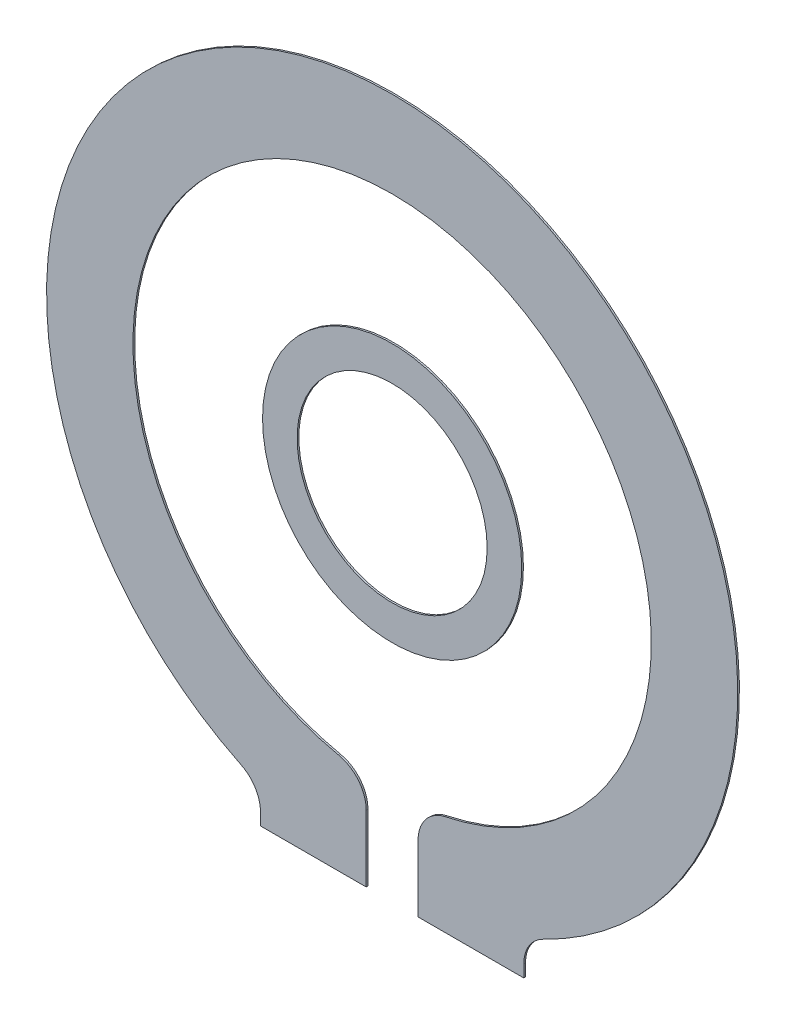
ISO-10303-21;
HEADER;
FILE_DESCRIPTION(('STEP AP214'),'2;1');
FILE_NAME('part.step','',(''),(''),'','','');
FILE_SCHEMA(('AUTOMOTIVE_DESIGN { 1 0 10303 214 1 1 1 1 }'));
ENDSEC;
DATA;
#1=APPLICATION_CONTEXT('core data for automotive mechanical design processes');
#2=APPLICATION_PROTOCOL_DEFINITION('international standard','automotive_design',2000,#1);
#3=PRODUCT_CONTEXT('',#1,'mechanical');
#4=PRODUCT('Part','Part','',(#3));
#5=PRODUCT_RELATED_PRODUCT_CATEGORY('part','',(#4));
#6=PRODUCT_DEFINITION_FORMATION('','',#4);
#7=PRODUCT_DEFINITION_CONTEXT('part definition',#1,'design');
#8=PRODUCT_DEFINITION('design','',#6,#7);
#9=PRODUCT_DEFINITION_SHAPE('','',#8);
#10=(LENGTH_UNIT() NAMED_UNIT(*) SI_UNIT(.MILLI.,.METRE.));
#11=(NAMED_UNIT(*) PLANE_ANGLE_UNIT() SI_UNIT($,.RADIAN.));
#12=(NAMED_UNIT(*) SI_UNIT($,.STERADIAN.) SOLID_ANGLE_UNIT());
#13=UNCERTAINTY_MEASURE_WITH_UNIT(LENGTH_MEASURE(1.E-05),#10,'distance_accuracy_value','');
#14=(GEOMETRIC_REPRESENTATION_CONTEXT(3) GLOBAL_UNCERTAINTY_ASSIGNED_CONTEXT((#13)) GLOBAL_UNIT_ASSIGNED_CONTEXT((#10,
#11,#12)) REPRESENTATION_CONTEXT('',''));
#15=CARTESIAN_POINT('',(0.,0.,0.));
#16=DIRECTION('',(0.,0.,1.));
#17=DIRECTION('',(1.,0.,0.));
#18=AXIS2_PLACEMENT_3D('',#15,#16,#17);
#19=CARTESIAN_POINT('',(3.80999999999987,-9.89261846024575,0.05));
#20=DIRECTION('',(-1.,0.,0.));
#21=DIRECTION('',(0.,0.,1.));
#22=AXIS2_PLACEMENT_3D('',#19,#20,#21);
#23=PLANE('',#22);
#24=DIRECTION('',(0.,1.,0.));
#25=VECTOR('',#24,1.);
#26=CARTESIAN_POINT('',(3.80999999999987,-9.89261846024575,0.));
#27=LINE('',#26,#25);
#28=CARTESIAN_POINT('',(3.80999999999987,-10.2457503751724,0.));
#29=VERTEX_POINT('',#28);
#30=CARTESIAN_POINT('',(3.8099999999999,-9.89261846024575,0.));
#31=VERTEX_POINT('',#30);
#32=EDGE_CURVE('E171',#29,#31,#27,.T.);
#33=ORIENTED_EDGE('',*,*,#32,.T.);
#34=DIRECTION('',(0.,0.,-1.));
#35=VECTOR('',#34,1.);
#36=CARTESIAN_POINT('',(3.8099999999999,-9.89261846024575,0.05));
#37=LINE('',#36,#35);
#38=CARTESIAN_POINT('',(3.8099999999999,-9.89261846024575,0.05));
#39=VERTEX_POINT('',#38);
#40=EDGE_CURVE('E12',#39,#31,#37,.T.);
#41=ORIENTED_EDGE('',*,*,#40,.F.);
#42=DIRECTION('',(0.,1.,0.));
#43=VECTOR('',#42,1.);
#44=CARTESIAN_POINT('',(3.80999999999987,-9.89261846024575,0.05));
#45=LINE('',#44,#43);
#46=CARTESIAN_POINT('',(3.80999999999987,-10.2457503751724,0.05));
#47=VERTEX_POINT('',#46);
#48=EDGE_CURVE('E204',#47,#39,#45,.T.);
#49=ORIENTED_EDGE('',*,*,#48,.F.);
#50=DIRECTION('',(0.,0.,-1.));
#51=VECTOR('',#50,1.);
#52=CARTESIAN_POINT('',(3.80999999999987,-10.2457503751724,0.05));
#53=LINE('',#52,#51);
#54=EDGE_CURVE('E167',#47,#29,#53,.T.);
#55=ORIENTED_EDGE('',*,*,#54,.T.);
#56=EDGE_LOOP('',(#33,#41,#49,#55));
#57=FACE_BOUND('',#56,.T.);
#58=ADVANCED_FACE('F44',(#57),#23,.F.);
#59=CARTESIAN_POINT('',(4.81000000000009,-9.89261846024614,0.05));
#60=DIRECTION('',(0.,0.,-1.));
#61=DIRECTION('',(-1.,0.,0.));
#62=AXIS2_PLACEMENT_3D('',#59,#60,#61);
#63=CYLINDRICAL_SURFACE('',#62,1.00000000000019);
#64=CARTESIAN_POINT('',(4.81000000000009,-9.89261846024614,0.));
#65=DIRECTION('',(0.,0.,-1.));
#66=DIRECTION('',(1.,0.,0.));
#67=AXIS2_PLACEMENT_3D('',#64,#65,#66);
#68=CIRCLE('',#67,1.00000000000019);
#69=CARTESIAN_POINT('',(4.37272727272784,-8.99328950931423,0.));
#70=VERTEX_POINT('',#69);
#71=EDGE_CURVE('E175',#31,#70,#68,.T.);
#72=ORIENTED_EDGE('',*,*,#71,.T.);
#73=DIRECTION('',(0.,0.,-1.));
#74=VECTOR('',#73,1.);
#75=CARTESIAN_POINT('',(4.37272727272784,-8.99328950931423,0.05));
#76=LINE('',#75,#74);
#77=CARTESIAN_POINT('',(4.37272727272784,-8.99328950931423,0.05));
#78=VERTEX_POINT('',#77);
#79=EDGE_CURVE('E53',#78,#70,#76,.T.);
#80=ORIENTED_EDGE('',*,*,#79,.F.);
#81=CARTESIAN_POINT('',(4.81000000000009,-9.89261846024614,0.05));
#82=DIRECTION('',(0.,0.,-1.));
#83=DIRECTION('',(1.,0.,0.));
#84=AXIS2_PLACEMENT_3D('',#81,#82,#83);
#85=CIRCLE('',#84,1.00000000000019);
#86=EDGE_CURVE('E116',#39,#78,#85,.T.);
#87=ORIENTED_EDGE('',*,*,#86,.F.);
#88=ORIENTED_EDGE('',*,*,#40,.T.);
#89=EDGE_LOOP('',(#72,#80,#87,#88));
#90=FACE_BOUND('',#89,.T.);
#91=ADVANCED_FACE('F297',(#90),#63,.F.);
#92=CARTESIAN_POINT('',(0.,0.,0.05));
#93=DIRECTION('',(0.,0.,-1.));
#94=DIRECTION('',(-1.,0.,0.));
#95=AXIS2_PLACEMENT_3D('',#92,#93,#94);
#96=CYLINDRICAL_SURFACE('',#95,9.99999999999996);
#97=CARTESIAN_POINT('',(0.,0.,0.));
#98=DIRECTION('',(0.,0.,1.));
#99=DIRECTION('',(1.,0.,0.));
#100=AXIS2_PLACEMENT_3D('',#97,#98,#99);
#101=CIRCLE('',#100,9.99999999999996);
#102=CARTESIAN_POINT('',(-4.37272727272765,-8.99328950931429,0.));
#103=VERTEX_POINT('',#102);
#104=EDGE_CURVE('E178',#70,#103,#101,.T.);
#105=ORIENTED_EDGE('',*,*,#104,.T.);
#106=DIRECTION('',(0.,0.,-1.));
#107=VECTOR('',#106,1.);
#108=CARTESIAN_POINT('',(-4.37272727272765,-8.99328950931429,0.05));
#109=LINE('',#108,#107);
#110=CARTESIAN_POINT('',(-4.37272727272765,-8.99328950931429,0.05));
#111=VERTEX_POINT('',#110);
#112=EDGE_CURVE('E230',#111,#103,#109,.T.);
#113=ORIENTED_EDGE('',*,*,#112,.F.);
#114=CARTESIAN_POINT('',(0.,0.,0.05));
#115=DIRECTION('',(0.,0.,1.));
#116=DIRECTION('',(1.,0.,0.));
#117=AXIS2_PLACEMENT_3D('',#114,#115,#116);
#118=CIRCLE('',#117,9.99999999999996);
#119=EDGE_CURVE('E240',#78,#111,#118,.T.);
#120=ORIENTED_EDGE('',*,*,#119,.F.);
#121=ORIENTED_EDGE('',*,*,#79,.T.);
#122=EDGE_LOOP('',(#105,#113,#120,#121));
#123=FACE_BOUND('',#122,.T.);
#124=ADVANCED_FACE('F238',(#123),#96,.T.);
#125=CARTESIAN_POINT('',(-4.81000000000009,-9.89261846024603,0.05));
#126=DIRECTION('',(0.,0.,-1.));
#127=DIRECTION('',(-1.,0.,0.));
#128=AXIS2_PLACEMENT_3D('',#125,#126,#127);
#129=CYLINDRICAL_SURFACE('',#128,1.00000000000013);
#130=CARTESIAN_POINT('',(-4.81000000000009,-9.89261846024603,0.));
#131=DIRECTION('',(0.,0.,-1.));
#132=DIRECTION('',(1.,0.,0.));
#133=AXIS2_PLACEMENT_3D('',#130,#131,#132);
#134=CIRCLE('',#133,1.00000000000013);
#135=CARTESIAN_POINT('',(-3.80999999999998,-9.89261846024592,0.));
#136=VERTEX_POINT('',#135);
#137=EDGE_CURVE('E181',#103,#136,#134,.T.);
#138=ORIENTED_EDGE('',*,*,#137,.T.);
#139=DIRECTION('',(0.,0.,-1.));
#140=VECTOR('',#139,1.);
#141=CARTESIAN_POINT('',(-3.80999999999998,-9.89261846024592,0.05));
#142=LINE('',#141,#140);
#143=CARTESIAN_POINT('',(-3.80999999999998,-9.89261846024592,0.05));
#144=VERTEX_POINT('',#143);
#145=EDGE_CURVE('E226',#144,#136,#142,.T.);
#146=ORIENTED_EDGE('',*,*,#145,.F.);
#147=CARTESIAN_POINT('',(-4.81000000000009,-9.89261846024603,0.05));
#148=DIRECTION('',(0.,0.,-1.));
#149=DIRECTION('',(1.,0.,0.));
#150=AXIS2_PLACEMENT_3D('',#147,#148,#149);
#151=CIRCLE('',#150,1.00000000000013);
#152=EDGE_CURVE('E259',#111,#144,#151,.T.);
#153=ORIENTED_EDGE('',*,*,#152,.F.);
#154=ORIENTED_EDGE('',*,*,#112,.T.);
#155=EDGE_LOOP('',(#138,#146,#153,#154));
#156=FACE_BOUND('',#155,.T.);
#157=ADVANCED_FACE('F249',(#156),#129,.F.);
#158=CARTESIAN_POINT('',(-3.80999999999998,-10.2457503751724,0.05));
#159=DIRECTION('',(1.,0.,0.));
#160=DIRECTION('',(0.,0.,-1.));
#161=AXIS2_PLACEMENT_3D('',#158,#159,#160);
#162=PLANE('',#161);
#163=DIRECTION('',(0.,-1.,0.));
#164=VECTOR('',#163,1.);
#165=CARTESIAN_POINT('',(-3.80999999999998,-10.2457503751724,0.));
#166=LINE('',#165,#164);
#167=CARTESIAN_POINT('',(-3.80999999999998,-10.2457503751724,0.));
#168=VERTEX_POINT('',#167);
#169=EDGE_CURVE('E184',#136,#168,#166,.T.);
#170=ORIENTED_EDGE('',*,*,#169,.T.);
#171=DIRECTION('',(0.,0.,-1.));
#172=VECTOR('',#171,1.);
#173=CARTESIAN_POINT('',(-3.80999999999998,-10.2457503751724,0.05));
#174=LINE('',#173,#172);
#175=CARTESIAN_POINT('',(-3.80999999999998,-10.2457503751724,0.05));
#176=VERTEX_POINT('',#175);
#177=EDGE_CURVE('E222',#176,#168,#174,.T.);
#178=ORIENTED_EDGE('',*,*,#177,.F.);
#179=DIRECTION('',(0.,-1.,0.));
#180=VECTOR('',#179,1.);
#181=CARTESIAN_POINT('',(-3.80999999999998,-10.2457503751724,0.05));
#182=LINE('',#181,#180);
#183=EDGE_CURVE('E255',#144,#176,#182,.T.);
#184=ORIENTED_EDGE('',*,*,#183,.F.);
#185=ORIENTED_EDGE('',*,*,#145,.T.);
#186=EDGE_LOOP('',(#170,#178,#184,#185));
#187=FACE_BOUND('',#186,.T.);
#188=ADVANCED_FACE('F253',(#187),#162,.F.);
#189=CARTESIAN_POINT('',(-0.75000000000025,-10.2457503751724,0.05));
#190=DIRECTION('',(0.,1.,0.));
#191=DIRECTION('',(0.,0.,1.));
#192=AXIS2_PLACEMENT_3D('',#189,#190,#191);
#193=PLANE('',#192);
#194=DIRECTION('',(1.,0.,0.));
#195=VECTOR('',#194,1.);
#196=CARTESIAN_POINT('',(-0.75000000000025,-10.2457503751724,0.));
#197=LINE('',#196,#195);
#198=CARTESIAN_POINT('',(-0.75000000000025,-10.2457503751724,0.));
#199=VERTEX_POINT('',#198);
#200=EDGE_CURVE('E187',#168,#199,#197,.T.);
#201=ORIENTED_EDGE('',*,*,#200,.T.);
#202=DIRECTION('',(0.,0.,-1.));
#203=VECTOR('',#202,1.);
#204=CARTESIAN_POINT('',(-0.75000000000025,-10.2457503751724,0.05));
#205=LINE('',#204,#203);
#206=CARTESIAN_POINT('',(-0.75000000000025,-10.2457503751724,0.05));
#207=VERTEX_POINT('',#206);
#208=EDGE_CURVE('E218',#207,#199,#205,.T.);
#209=ORIENTED_EDGE('',*,*,#208,.F.);
#210=DIRECTION('',(1.,0.,0.));
#211=VECTOR('',#210,1.);
#212=CARTESIAN_POINT('',(-0.75000000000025,-10.2457503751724,0.05));
#213=LINE('',#212,#211);
#214=EDGE_CURVE('E258',#176,#207,#213,.T.);
#215=ORIENTED_EDGE('',*,*,#214,.F.);
#216=ORIENTED_EDGE('',*,*,#177,.T.);
#217=EDGE_LOOP('',(#201,#209,#215,#216));
#218=FACE_BOUND('',#217,.T.);
#219=ADVANCED_FACE('F310',(#218),#193,.F.);
#220=CARTESIAN_POINT('',(-0.75000000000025,-8.31790237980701,0.05));
#221=DIRECTION('',(-1.,0.,0.));
#222=DIRECTION('',(0.,0.,1.));
#223=AXIS2_PLACEMENT_3D('',#220,#221,#222);
#224=PLANE('',#223);
#225=DIRECTION('',(0.,1.,0.));
#226=VECTOR('',#225,1.);
#227=CARTESIAN_POINT('',(-0.75000000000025,-8.31790237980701,0.));
#228=LINE('',#227,#226);
#229=CARTESIAN_POINT('',(-0.750000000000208,-8.31790237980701,0.));
#230=VERTEX_POINT('',#229);
#231=EDGE_CURVE('E190',#199,#230,#228,.T.);
#232=ORIENTED_EDGE('',*,*,#231,.T.);
#233=DIRECTION('',(0.,0.,-1.));
#234=VECTOR('',#233,1.);
#235=CARTESIAN_POINT('',(-0.750000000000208,-8.31790237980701,0.05));
#236=LINE('',#235,#234);
#237=CARTESIAN_POINT('',(-0.750000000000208,-8.31790237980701,0.05));
#238=VERTEX_POINT('',#237);
#239=EDGE_CURVE('E214',#238,#230,#236,.T.);
#240=ORIENTED_EDGE('',*,*,#239,.F.);
#241=DIRECTION('',(0.,1.,0.));
#242=VECTOR('',#241,1.);
#243=CARTESIAN_POINT('',(-0.75000000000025,-8.31790237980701,0.05));
#244=LINE('',#243,#242);
#245=EDGE_CURVE('E262',#207,#238,#244,.T.);
#246=ORIENTED_EDGE('',*,*,#245,.F.);
#247=ORIENTED_EDGE('',*,*,#208,.T.);
#248=EDGE_LOOP('',(#232,#240,#246,#247));
#249=FACE_BOUND('',#248,.T.);
#250=ADVANCED_FACE('F313',(#249),#224,.F.);
#251=CARTESIAN_POINT('',(-1.74999999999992,-8.31790237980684,0.05));
#252=DIRECTION('',(0.,0.,-1.));
#253=DIRECTION('',(-1.,0.,0.));
#254=AXIS2_PLACEMENT_3D('',#251,#252,#253);
#255=CYLINDRICAL_SURFACE('',#254,0.99999999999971);
#256=CARTESIAN_POINT('',(-1.74999999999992,-8.31790237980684,0.));
#257=DIRECTION('',(0.,0.,1.));
#258=DIRECTION('',(1.,0.,0.));
#259=AXIS2_PLACEMENT_3D('',#256,#257,#258);
#260=CIRCLE('',#259,0.99999999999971);
#261=CARTESIAN_POINT('',(-1.54411764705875,-7.33932562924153,0.));
#262=VERTEX_POINT('',#261);
#263=EDGE_CURVE('E193',#230,#262,#260,.T.);
#264=ORIENTED_EDGE('',*,*,#263,.T.);
#265=DIRECTION('',(0.,0.,-1.));
#266=VECTOR('',#265,1.);
#267=CARTESIAN_POINT('',(-1.54411764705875,-7.33932562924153,0.05));
#268=LINE('',#267,#266);
#269=CARTESIAN_POINT('',(-1.54411764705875,-7.33932562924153,0.05));
#270=VERTEX_POINT('',#269);
#271=EDGE_CURVE('E210',#270,#262,#268,.T.);
#272=ORIENTED_EDGE('',*,*,#271,.F.);
#273=CARTESIAN_POINT('',(-1.74999999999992,-8.31790237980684,0.05));
#274=DIRECTION('',(0.,0.,1.));
#275=DIRECTION('',(1.,0.,0.));
#276=AXIS2_PLACEMENT_3D('',#273,#274,#275);
#277=CIRCLE('',#276,0.99999999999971);
#278=EDGE_CURVE('E270',#238,#270,#277,.T.);
#279=ORIENTED_EDGE('',*,*,#278,.F.);
#280=ORIENTED_EDGE('',*,*,#239,.T.);
#281=EDGE_LOOP('',(#264,#272,#279,#280));
#282=FACE_BOUND('',#281,.T.);
#283=ADVANCED_FACE('F278',(#282),#255,.T.);
#284=CARTESIAN_POINT('',(0.,0.,0.05));
#285=DIRECTION('',(0.,0.,-1.));
#286=DIRECTION('',(-1.,0.,0.));
#287=AXIS2_PLACEMENT_3D('',#284,#285,#286);
#288=CYLINDRICAL_SURFACE('',#287,7.49999999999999);
#289=CARTESIAN_POINT('',(0.,0.,0.));
#290=DIRECTION('',(0.,0.,-1.));
#291=DIRECTION('',(1.,0.,0.));
#292=AXIS2_PLACEMENT_3D('',#289,#290,#291);
#293=CIRCLE('',#292,7.49999999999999);
#294=CARTESIAN_POINT('',(1.54411764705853,-7.33932562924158,0.));
#295=VERTEX_POINT('',#294);
#296=EDGE_CURVE('E196',#262,#295,#293,.T.);
#297=ORIENTED_EDGE('',*,*,#296,.T.);
#298=DIRECTION('',(0.,0.,-1.));
#299=VECTOR('',#298,1.);
#300=CARTESIAN_POINT('',(1.54411764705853,-7.33932562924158,0.05));
#301=LINE('',#300,#299);
#302=CARTESIAN_POINT('',(1.54411764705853,-7.33932562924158,0.05));
#303=VERTEX_POINT('',#302);
#304=EDGE_CURVE('E158',#303,#295,#301,.T.);
#305=ORIENTED_EDGE('',*,*,#304,.F.);
#306=CARTESIAN_POINT('',(0.,0.,0.05));
#307=DIRECTION('',(0.,0.,-1.));
#308=DIRECTION('',(1.,0.,0.));
#309=AXIS2_PLACEMENT_3D('',#306,#307,#308);
#310=CIRCLE('',#309,7.49999999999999);
#311=EDGE_CURVE('E147',#270,#303,#310,.T.);
#312=ORIENTED_EDGE('',*,*,#311,.F.);
#313=ORIENTED_EDGE('',*,*,#271,.T.);
#314=EDGE_LOOP('',(#297,#305,#312,#313));
#315=FACE_BOUND('',#314,.T.);
#316=ADVANCED_FACE('F282',(#315),#288,.F.);
#317=CARTESIAN_POINT('',(1.74999999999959,-8.31790237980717,0.05));
#318=DIRECTION('',(0.,0.,-1.));
#319=DIRECTION('',(-1.,0.,0.));
#320=AXIS2_PLACEMENT_3D('',#317,#318,#319);
#321=CYLINDRICAL_SURFACE('',#320,1.00000000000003);
#322=CARTESIAN_POINT('',(1.74999999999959,-8.31790237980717,0.));
#323=DIRECTION('',(0.,0.,1.));
#324=DIRECTION('',(1.,0.,0.));
#325=AXIS2_PLACEMENT_3D('',#322,#323,#324);
#326=CIRCLE('',#325,1.00000000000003);
#327=CARTESIAN_POINT('',(0.749999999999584,-8.31790237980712,0.));
#328=VERTEX_POINT('',#327);
#329=EDGE_CURVE('E156',#295,#328,#326,.T.);
#330=ORIENTED_EDGE('',*,*,#329,.T.);
#331=DIRECTION('',(0.,0.,-1.));
#332=VECTOR('',#331,1.);
#333=CARTESIAN_POINT('',(0.749999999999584,-8.31790237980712,0.05));
#334=LINE('',#333,#332);
#335=CARTESIAN_POINT('',(0.749999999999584,-8.31790237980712,0.05));
#336=VERTEX_POINT('',#335);
#337=EDGE_CURVE('E153',#336,#328,#334,.T.);
#338=ORIENTED_EDGE('',*,*,#337,.F.);
#339=CARTESIAN_POINT('',(1.74999999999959,-8.31790237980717,0.05));
#340=DIRECTION('',(0.,0.,1.));
#341=DIRECTION('',(1.,0.,0.));
#342=AXIS2_PLACEMENT_3D('',#339,#340,#341);
#343=CIRCLE('',#342,1.00000000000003);
#344=EDGE_CURVE('E141',#303,#336,#343,.T.);
#345=ORIENTED_EDGE('',*,*,#344,.F.);
#346=ORIENTED_EDGE('',*,*,#304,.T.);
#347=EDGE_LOOP('',(#330,#338,#345,#346));
#348=FACE_BOUND('',#347,.T.);
#349=ADVANCED_FACE('F154',(#348),#321,.T.);
#350=CARTESIAN_POINT('',(0.749999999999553,-10.2457503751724,0.05));
#351=DIRECTION('',(1.,0.,0.));
#352=DIRECTION('',(0.,1.,0.));
#353=AXIS2_PLACEMENT_3D('',#350,#351,#352);
#354=PLANE('',#353);
#355=DIRECTION('',(0.,-1.,0.));
#356=VECTOR('',#355,1.);
#357=CARTESIAN_POINT('',(0.749999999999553,-10.2457503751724,0.));
#358=LINE('',#357,#356);
#359=CARTESIAN_POINT('',(0.749999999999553,-10.2457503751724,0.));
#360=VERTEX_POINT('',#359);
#361=EDGE_CURVE('E102',#328,#360,#358,.T.);
#362=ORIENTED_EDGE('',*,*,#361,.T.);
#363=DIRECTION('',(0.,0.,-1.));
#364=VECTOR('',#363,1.);
#365=CARTESIAN_POINT('',(0.749999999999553,-10.2457503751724,0.05));
#366=LINE('',#365,#364);
#367=CARTESIAN_POINT('',(0.749999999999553,-10.2457503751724,0.05));
#368=VERTEX_POINT('',#367);
#369=EDGE_CURVE('E159',#368,#360,#366,.T.);
#370=ORIENTED_EDGE('',*,*,#369,.F.);
#371=DIRECTION('',(0.,-1.,0.));
#372=VECTOR('',#371,1.);
#373=CARTESIAN_POINT('',(0.749999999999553,-10.2457503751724,0.05));
#374=LINE('',#373,#372);
#375=EDGE_CURVE('E145',#336,#368,#374,.T.);
#376=ORIENTED_EDGE('',*,*,#375,.F.);
#377=ORIENTED_EDGE('',*,*,#337,.T.);
#378=EDGE_LOOP('',(#362,#370,#376,#377));
#379=FACE_BOUND('',#378,.T.);
#380=ADVANCED_FACE('F161',(#379),#354,.F.);
#381=CARTESIAN_POINT('',(3.80999999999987,-10.2457503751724,0.05));
#382=DIRECTION('',(0.,1.,0.));
#383=DIRECTION('',(0.,0.,1.));
#384=AXIS2_PLACEMENT_3D('',#381,#382,#383);
#385=PLANE('',#384);
#386=DIRECTION('',(1.,0.,0.));
#387=VECTOR('',#386,1.);
#388=CARTESIAN_POINT('',(3.80999999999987,-10.2457503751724,0.));
#389=LINE('',#388,#387);
#390=EDGE_CURVE('E108',#360,#29,#389,.T.);
#391=ORIENTED_EDGE('',*,*,#390,.T.);
#392=ORIENTED_EDGE('',*,*,#54,.F.);
#393=DIRECTION('',(1.,0.,0.));
#394=VECTOR('',#393,1.);
#395=CARTESIAN_POINT('',(3.80999999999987,-10.2457503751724,0.05));
#396=LINE('',#395,#394);
#397=EDGE_CURVE('E61',#368,#47,#396,.T.);
#398=ORIENTED_EDGE('',*,*,#397,.F.);
#399=ORIENTED_EDGE('',*,*,#369,.T.);
#400=EDGE_LOOP('',(#391,#392,#398,#399));
#401=FACE_BOUND('',#400,.T.);
#402=ADVANCED_FACE('F286',(#401),#385,.F.);
#403=CARTESIAN_POINT('',(1.74999999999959,-8.31790237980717,0.05));
#404=DIRECTION('',(0.,0.,1.));
#405=DIRECTION('',(1.,0.,0.));
#406=AXIS2_PLACEMENT_3D('',#403,#404,#405);
#407=PLANE('',#406);
#408=ORIENTED_EDGE('',*,*,#48,.T.);
#409=ORIENTED_EDGE('',*,*,#86,.T.);
#410=ORIENTED_EDGE('',*,*,#119,.T.);
#411=ORIENTED_EDGE('',*,*,#152,.T.);
#412=ORIENTED_EDGE('',*,*,#183,.T.);
#413=ORIENTED_EDGE('',*,*,#214,.T.);
#414=ORIENTED_EDGE('',*,*,#245,.T.);
#415=ORIENTED_EDGE('',*,*,#278,.T.);
#416=ORIENTED_EDGE('',*,*,#311,.T.);
#417=ORIENTED_EDGE('',*,*,#344,.T.);
#418=ORIENTED_EDGE('',*,*,#375,.T.);
#419=ORIENTED_EDGE('',*,*,#397,.T.);
#420=EDGE_LOOP('',(#408,#409,#410,#411,#412,#413,#414,#415,#416,#417,#418,#419));
#421=FACE_BOUND('',#420,.T.);
#422=ADVANCED_FACE('F143',(#421),#407,.T.);
#423=CARTESIAN_POINT('',(1.74999999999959,-8.31790237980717,0.));
#424=DIRECTION('',(0.,0.,1.));
#425=DIRECTION('',(1.,0.,0.));
#426=AXIS2_PLACEMENT_3D('',#423,#424,#425);
#427=PLANE('',#426);
#428=ORIENTED_EDGE('',*,*,#32,.F.);
#429=ORIENTED_EDGE('',*,*,#390,.F.);
#430=ORIENTED_EDGE('',*,*,#361,.F.);
#431=ORIENTED_EDGE('',*,*,#329,.F.);
#432=ORIENTED_EDGE('',*,*,#296,.F.);
#433=ORIENTED_EDGE('',*,*,#263,.F.);
#434=ORIENTED_EDGE('',*,*,#231,.F.);
#435=ORIENTED_EDGE('',*,*,#200,.F.);
#436=ORIENTED_EDGE('',*,*,#169,.F.);
#437=ORIENTED_EDGE('',*,*,#137,.F.);
#438=ORIENTED_EDGE('',*,*,#104,.F.);
#439=ORIENTED_EDGE('',*,*,#71,.F.);
#440=EDGE_LOOP('',(#428,#429,#430,#431,#432,#433,#434,#435,#436,#437,#438,#439));
#441=FACE_BOUND('',#440,.T.);
#442=ADVANCED_FACE('F244',(#441),#427,.F.);
#443=CLOSED_SHELL('',(#58,#91,#124,#157,#188,#219,#250,#283,#316,#349,#380,#402,#422,#442));
#444=MANIFOLD_SOLID_BREP('B2',#443);
#445=CARTESIAN_POINT('',(0.,0.,0.05));
#446=DIRECTION('',(0.,0.,1.));
#447=DIRECTION('',(1.,0.,0.));
#448=AXIS2_PLACEMENT_3D('',#445,#446,#447);
#449=PLANE('',#448);
#450=CARTESIAN_POINT('',(0.,0.,0.05));
#451=DIRECTION('',(0.,0.,1.));
#452=DIRECTION('',(1.,0.,0.));
#453=AXIS2_PLACEMENT_3D('',#450,#451,#452);
#454=CIRCLE('',#453,3.75000000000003);
#455=CARTESIAN_POINT('',(3.75000000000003,0.,0.05));
#456=VERTEX_POINT('',#455);
#457=EDGE_CURVE('E43',#456,#456,#454,.T.);
#458=ORIENTED_EDGE('',*,*,#457,.T.);
#459=EDGE_LOOP('',(#458));
#460=FACE_BOUND('',#459,.T.);
#461=CARTESIAN_POINT('',(0.,0.,0.05));
#462=DIRECTION('',(0.,0.,1.));
#463=DIRECTION('',(1.,0.,0.));
#464=AXIS2_PLACEMENT_3D('',#461,#462,#463);
#465=CIRCLE('',#464,2.75000000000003);
#466=CARTESIAN_POINT('',(2.75000000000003,0.,0.05));
#467=VERTEX_POINT('',#466);
#468=EDGE_CURVE('E438',#467,#467,#465,.T.);
#469=ORIENTED_EDGE('',*,*,#468,.F.);
#470=EDGE_LOOP('',(#469));
#471=FACE_BOUND('',#470,.T.);
#472=ADVANCED_FACE('F425',(#460,#471),#449,.T.);
#473=CARTESIAN_POINT('',(0.,0.,0.));
#474=DIRECTION('',(0.,0.,1.));
#475=DIRECTION('',(1.,0.,0.));
#476=AXIS2_PLACEMENT_3D('',#473,#474,#475);
#477=PLANE('',#476);
#478=CARTESIAN_POINT('',(0.,0.,0.));
#479=DIRECTION('',(0.,0.,1.));
#480=DIRECTION('',(1.,0.,0.));
#481=AXIS2_PLACEMENT_3D('',#478,#479,#480);
#482=CIRCLE('',#481,3.75000000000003);
#483=CARTESIAN_POINT('',(3.75000000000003,0.,0.));
#484=VERTEX_POINT('',#483);
#485=EDGE_CURVE('E429',#484,#484,#482,.T.);
#486=ORIENTED_EDGE('',*,*,#485,.F.);
#487=EDGE_LOOP('',(#486));
#488=FACE_BOUND('',#487,.T.);
#489=CARTESIAN_POINT('',(0.,0.,0.));
#490=DIRECTION('',(0.,0.,1.));
#491=DIRECTION('',(1.,0.,0.));
#492=AXIS2_PLACEMENT_3D('',#489,#490,#491);
#493=CIRCLE('',#492,2.75000000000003);
#494=CARTESIAN_POINT('',(2.75000000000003,0.,0.));
#495=VERTEX_POINT('',#494);
#496=EDGE_CURVE('E440',#495,#495,#493,.T.);
#497=ORIENTED_EDGE('',*,*,#496,.T.);
#498=EDGE_LOOP('',(#497));
#499=FACE_BOUND('',#498,.T.);
#500=ADVANCED_FACE('F452',(#488,#499),#477,.F.);
#501=CARTESIAN_POINT('',(0.,0.,0.05));
#502=DIRECTION('',(0.,0.,-1.));
#503=DIRECTION('',(-1.,0.,0.));
#504=AXIS2_PLACEMENT_3D('',#501,#502,#503);
#505=CYLINDRICAL_SURFACE('',#504,3.75000000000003);
#506=ORIENTED_EDGE('',*,*,#457,.F.);
#507=EDGE_LOOP('',(#506));
#508=FACE_BOUND('',#507,.T.);
#509=ORIENTED_EDGE('',*,*,#485,.T.);
#510=EDGE_LOOP('',(#509));
#511=FACE_BOUND('',#510,.T.);
#512=ADVANCED_FACE('F427',(#508,#511),#505,.T.);
#513=CARTESIAN_POINT('',(0.,0.,0.05));
#514=DIRECTION('',(0.,0.,-1.));
#515=DIRECTION('',(-1.,0.,0.));
#516=AXIS2_PLACEMENT_3D('',#513,#514,#515);
#517=CYLINDRICAL_SURFACE('',#516,2.75000000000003);
#518=ORIENTED_EDGE('',*,*,#468,.T.);
#519=EDGE_LOOP('',(#518));
#520=FACE_BOUND('',#519,.T.);
#521=ORIENTED_EDGE('',*,*,#496,.F.);
#522=EDGE_LOOP('',(#521));
#523=FACE_BOUND('',#522,.T.);
#524=ADVANCED_FACE('F448',(#520,#523),#517,.F.);
#525=CLOSED_SHELL('',(#472,#500,#512,#524));
#526=MANIFOLD_SOLID_BREP('B6',#525);
#527=ADVANCED_BREP_SHAPE_REPRESENTATION('',(#18,#444,#526),#14);
#528=SHAPE_DEFINITION_REPRESENTATION(#9,#527);
ENDSEC;
END-ISO-10303-21;
